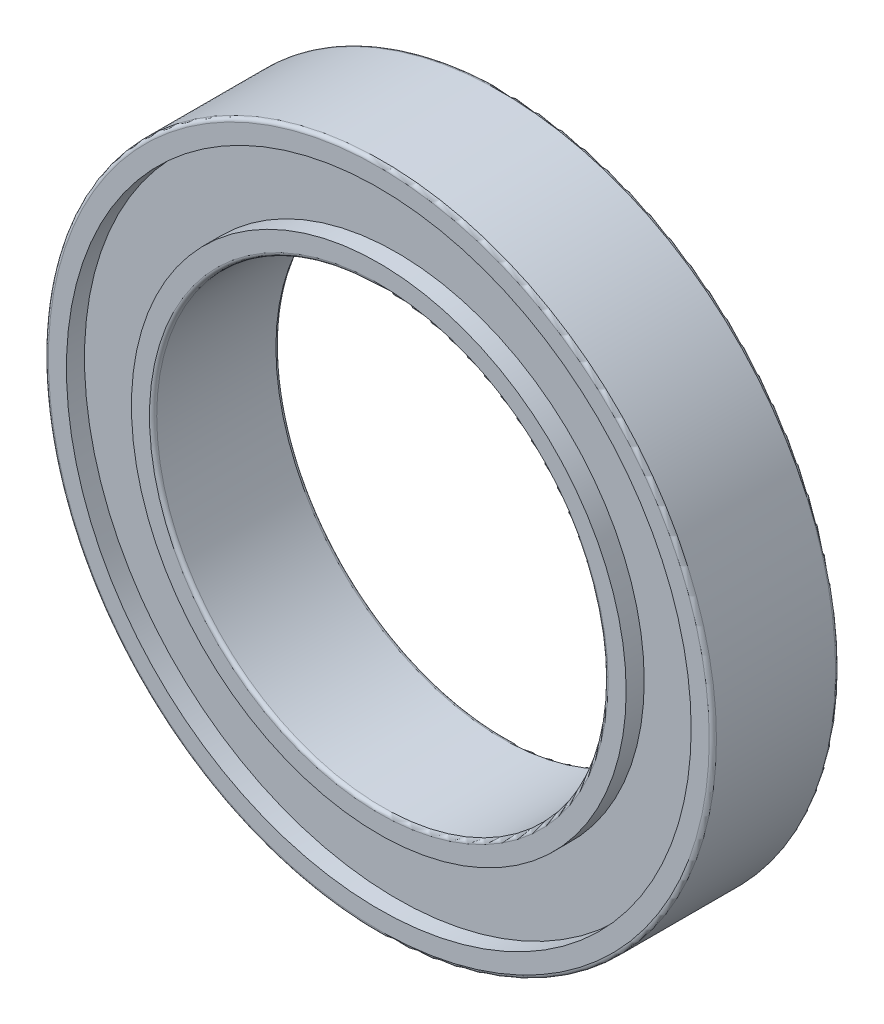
from build123d import *

# Parameters (mm, degrees)
SKETCH_1_R          = 18.5
SKETCH_1_R_2        = 12.5
EXTRUDE_1_DEPTH     = 7
SKETCH_2_R          = 17.3
SKETCH_2_R_2        = 13.7
CUT_EXTRUDE_1_DEPTH = 1
CUT_EXTRUDE_START   = -1
SKETCH_3_R          = 17.3
SKETCH_3_R_2        = 13.7
CUT_EXTRUDE_2_DEPTH = 1
FILLET_1_R          = 0.2


with BuildPart() as part:
    # Sketch 1 → Extrude 1 (new body)
    with BuildSketch(Plane.XY):
        Circle(SKETCH_1_R)
        Circle(SKETCH_1_R_2, mode=Mode.SUBTRACT)
    extrude(amount=EXTRUDE_1_DEPTH)

    # Sketch 2 → Cut-Extrude 1 (cut)
    with BuildSketch(Plane.XY.offset(7)):
        Circle(SKETCH_2_R)
        Circle(SKETCH_2_R_2, mode=Mode.SUBTRACT)
    extrude(amount=-CUT_EXTRUDE_1_DEPTH, mode=Mode.SUBTRACT)

    # Sketch 3 → Cut-Extrude 2 (cut)
    with BuildSketch(Plane(origin=(0, 0, 0), x_dir=(-1, 0, 0), z_dir=(0, 0, -1)).offset(CUT_EXTRUDE_START)):
        with Locations(Location((0, 0, 0), (0, 0, 180))):
            Circle(SKETCH_3_R)
        with Locations(Location((0, 0, 0), (0, 0, 180))):
            Circle(SKETCH_3_R_2, mode=Mode.SUBTRACT)
    extrude(amount=CUT_EXTRUDE_2_DEPTH, mode=Mode.SUBTRACT)

    # Fillet 1
    fillet_1_edges = [part.edges().sort_by_distance(p)[0] for p in [
        (-18.5, 0, 0),
        (-18.5, 0, 7),
        (-12.5, 0, 0),
        (-12.5, 0, 7),
    ]]
    fillet(fillet_1_edges, radius=FILLET_1_R)


solid = part.part
